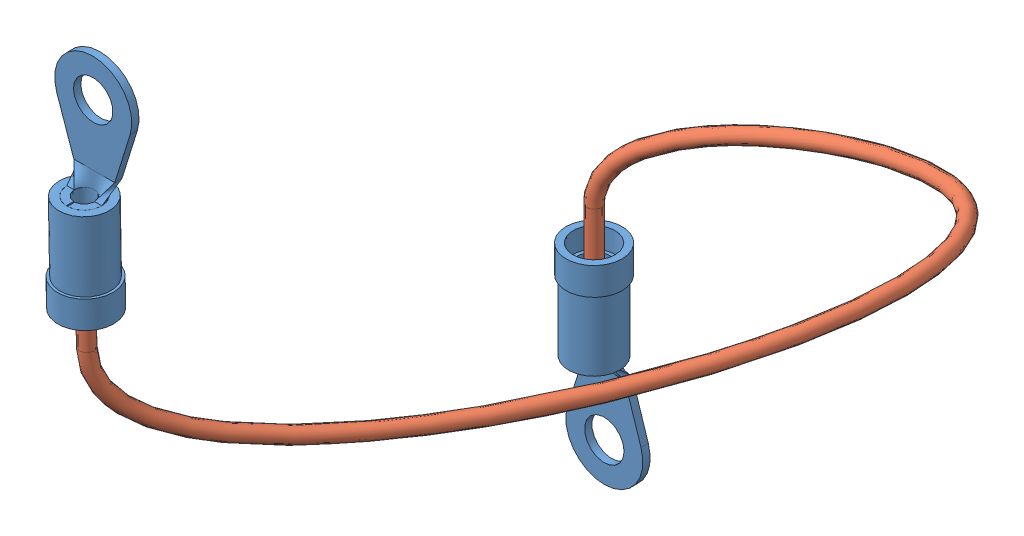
SolidWorks assembly Ring_0-6-001_10.sldasm, configuration Default (file format 13000). Lengths in mm.
Overall size (50.34 86.58 83.77).
3 component instances, 2 part files, 4 mates.
Components (placement in the parent):
- ring_term_awg-14_10-15: ring_term_awg-14_10.SLDPRT [Default] at (69.1868 136.9038 86.227) x (0 -0.999848 -0.017452) z (-1 0 0) size (27.02 6.1 8.38)
- ring_term_awg-14_10-16: ring_term_awg-14_10.SLDPRT [Default] at (50.8 58.7375 12.2873) x (0 1 0) z (1 0 0) size (27.02 6.1 8.38)
- Cable-Ring_0-6-001_10-1: Cable-Ring_0-6-001_10.sldprt [Default] at origin size (43.53 52.51 81.07)
Mates (geometry in assembly coordinates):
- Concentric11: concentric: cylinder of assembly through (69.1868 136.962 82.8937) axis (0 -0.017452 0.999848) radius 1.5875; cylinder of ring_term_awg-14_10-15 through (69.1868 136.9177 85.4333) axis (0 -0.017452 0.999848) radius 2.1463; cylinder of ?
- Coincident11: coincident anti-aligned: plane of ring_term_awg-14_10-15 through (69.1868 136.9177 85.4333) normal (0 0.017452 -0.999848); plane of assembly through (85.8 157.9245 85.8) normal (0 -0.017452 0.999848)
- Concentric21: concentric: cylinder of assembly through (50.8 58.7375 11.4935) axis (0 0 -1) radius 3.556; cylinder of ring_term_awg-14_10-16 through (50.8 58.7375 11.4935) axis (0 0 1) radius 2.1463; cylinder of ?
- Coincident21: coincident anti-aligned: plane of ring_term_awg-14_10-16 through (50.8 58.7375 11.4935) normal (0 0 -1); plane of assembly through (50.8 58.7375 11.4935) normal (0 0 1)
